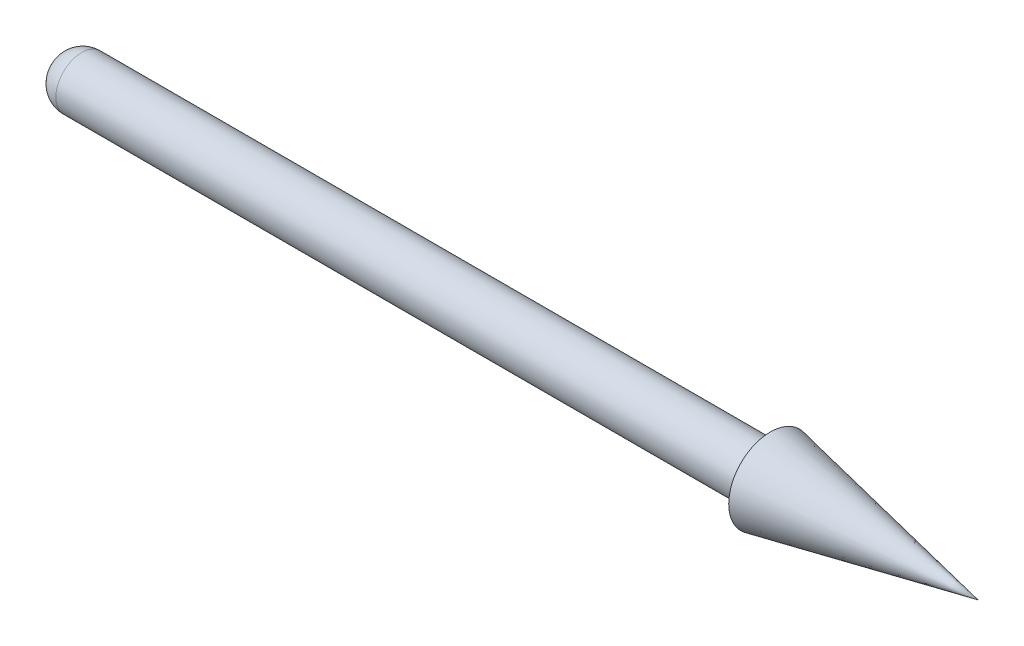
from build123d import *


with BuildPart() as part:
    # Esquisse1 → R_volution1 (revolve)
    with BuildSketch(Plane.XY, mode=Mode.PRIVATE) as r_volution1_sk:
        with BuildLine():
            Line((-1, 0), (20, 0))
            Line((20, 0), (30, 0))
            Line((30, 0), (23, 1.4))
            Line((23, 1.4), (23, 0.874234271))
            Line((23, 0.874234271), (-0.2, 0.874234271))
            ThreePointArc((-0.2, 0.874234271), (-0.765685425, 0.639919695), (-1, 0.074234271))
            Line((-1, 0.074234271), (-1, 0))
        make_face()
    revolve(r_volution1_sk.sketch.rotate(Axis((-1, 0, 0), (1, 0, 0)), 90), axis=Axis((-1, 0, 0), (1, 0, 0)))


solid = part.part
